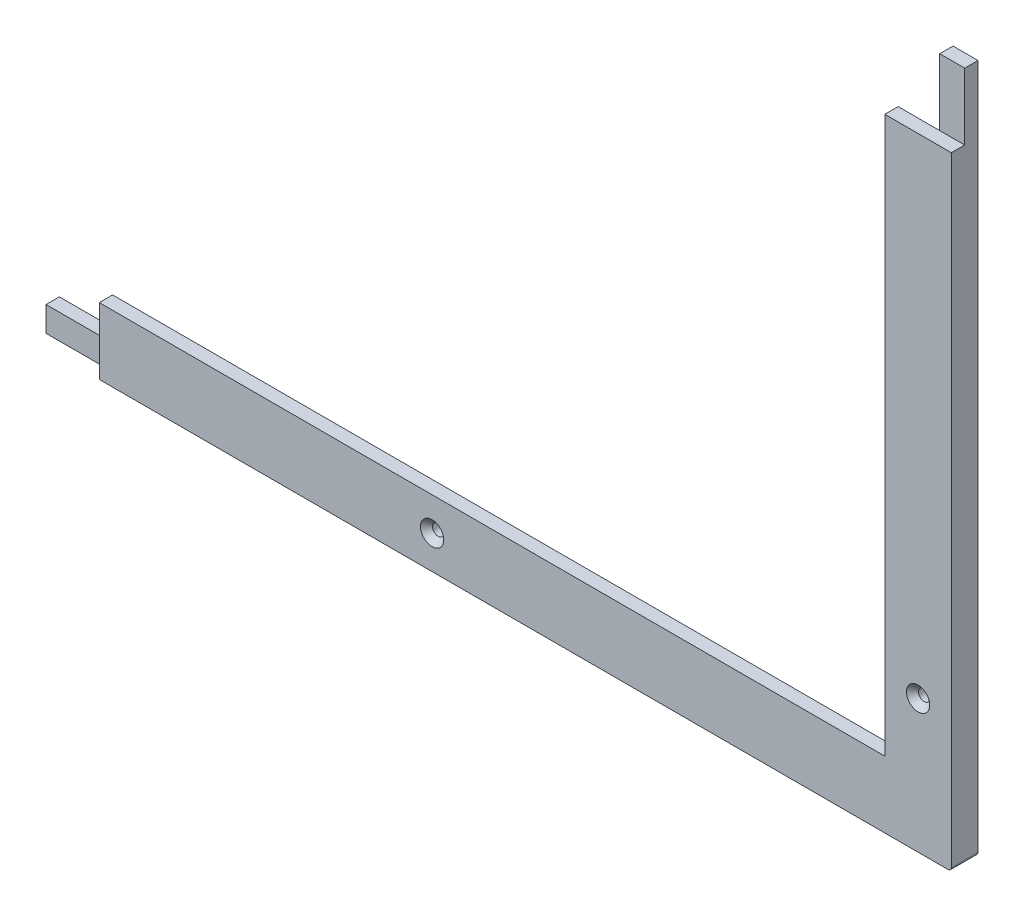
from build123d import *

# Parameters (mm, degrees)
SKIZZE1_W                                            = 532
SKIZZE1_H                                            = 394
SKIZZE1_W_2                                          = 492
SKIZZE1_H_2                                          = 354
AUFSATZ_LINEAR_AUSTRAGEN1_DEPTH                      = 8
VERRUNDUNG1_R                                        = 1
SKIZZE2_W                                            = 517
SKIZZE2_H                                            = 379
SCHNITT_LINEAR_AUSTRAGEN1_DEPTH                      = 4
FORMSENKUNG_F_R_M3_SENKSCHRAUBE_MIT_INNE_D           = 3.4
FORMSENKUNG_F_R_M3_SENKSCHRAUBE_MIT_INNE_CSINK_D     = 7
FORMSENKUNG_F_R_M3_SENKSCHRAUBE_MIT_INNE_CSINK_ANGLE = 90
SCHNITT_LINEAR_AUSTRAGEN2_DEPTH                      = 332.1027031
SCHNITT_LINEAR_AUSTRAGEN3_DEPTH                      = 332.1027031
SCHNITT_LINEAR_AUSTRAGEN4_DEPTH                      = 332.1027031
SCHNITT_LINEAR_AUSTRAGEN4_DEPTH_BACK                 = 332.1027031


with BuildPart() as part:
    # Skizze1 → Aufsatz-Linear austragen1 (new body)
    with BuildSketch(Plane.XY):
        Rectangle(SKIZZE1_W, SKIZZE1_H)
        Rectangle(SKIZZE1_W_2, SKIZZE1_H_2, mode=Mode.SUBTRACT)
    extrude(amount=AUFSATZ_LINEAR_AUSTRAGEN1_DEPTH)

    # Verrundung1
    verrundung1_edges = [part.edges().sort_by_distance(p)[0] for p in [
        (266, -197, 4),
        (-266, -197, 4),
        (-266, 197, 4),
        (266, 197, 4),
    ]]
    fillet(verrundung1_edges, radius=VERRUNDUNG1_R)

    # Skizze2 → Schnitt-Linear austragen1 (cut)
    with BuildSketch(Plane(origin=(0, 0, 0), x_dir=(-1, 0, 0), z_dir=(0, 0, -1))):
        Rectangle(SKIZZE2_W, SKIZZE2_H)
    extrude(amount=-SCHNITT_LINEAR_AUSTRAGEN1_DEPTH, mode=Mode.SUBTRACT)

    # Formsenkung f_r M3 Senkschraube mit Inne (through all)
    with Locations(Plane.XY.offset(8)):
        with Locations((-110, -187), (110, -187), (110, 187), (-110, 187), (256, 157), (256, -157), (-256, -157), (-256, 157), (-256, 0), (256, 0)):
            CounterSinkHole(FORMSENKUNG_F_R_M3_SENKSCHRAUBE_MIT_INNE_D / 2, FORMSENKUNG_F_R_M3_SENKSCHRAUBE_MIT_INNE_CSINK_D / 2, counter_sink_angle=FORMSENKUNG_F_R_M3_SENKSCHRAUBE_MIT_INNE_CSINK_ANGLE)

    # Skizze5 → Schnitt-Linear austragen2 (cut, through all)
    with BuildSketch(Plane(origin=(0, 0, 0), x_dir=(0, 0, -1), z_dir=(1, 0, 0))):
        Polygon((-8, 197), (-8, -10), (-4, -10), (-4, 10), (0, 10), (0, 197), align=None)
    extrude(amount=SCHNITT_LINEAR_AUSTRAGEN2_DEPTH, mode=Mode.SUBTRACT)

    # Skizze6 → Schnitt-Linear austragen3 (cut, through all)
    with BuildSketch(Plane(origin=(0, 0, 0), x_dir=(0, 0, -1), z_dir=(1, 0, 0))):
        Polygon((-8, 197), (-8, -10), (-4, -10), (-4, 10), (0, 10), (0, 197), align=None)
    extrude(amount=-SCHNITT_LINEAR_AUSTRAGEN3_DEPTH, mode=Mode.SUBTRACT)

    # Skizze7 → Schnitt-Linear austragen4 (cut, two sides: drawn at the far end of the back side and taken through both)
    with BuildSketch(Plane(origin=(0, 0, 0), x_dir=(1, 0, 0), z_dir=(0, 1, 0)).offset(-SCHNITT_LINEAR_AUSTRAGEN4_DEPTH_BACK)):
        Polygon((-266, -8), (-266, 0), (-10, 0), (-10, -4), (10, -4), (10, -8), align=None)
    extrude(amount=SCHNITT_LINEAR_AUSTRAGEN4_DEPTH + SCHNITT_LINEAR_AUSTRAGEN4_DEPTH_BACK, mode=Mode.SUBTRACT)


solid = part.part
